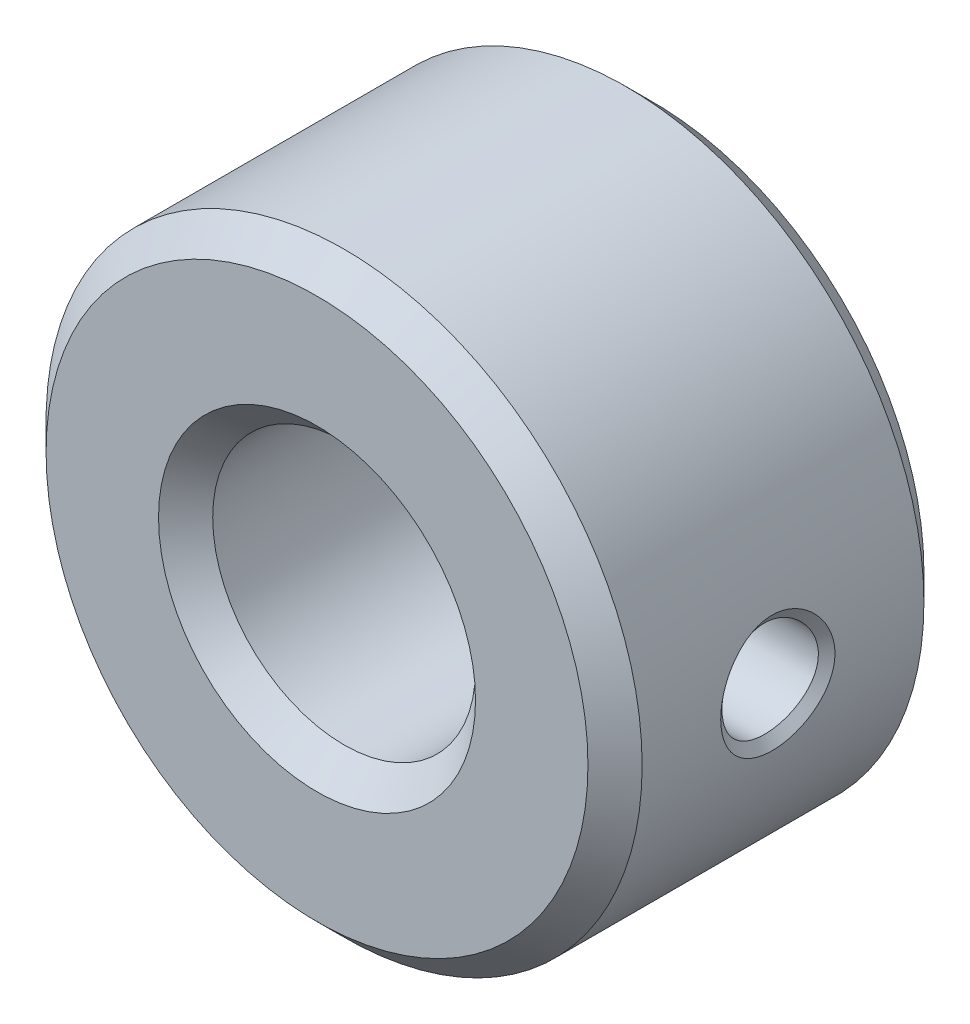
ISO-10303-21;
HEADER;
FILE_DESCRIPTION(('STEP AP214'),'2;1');
FILE_NAME('part.step','',(''),(''),'','','');
FILE_SCHEMA(('AUTOMOTIVE_DESIGN { 1 0 10303 214 1 1 1 1 }'));
ENDSEC;
DATA;
#1=APPLICATION_CONTEXT('core data for automotive mechanical design processes');
#2=APPLICATION_PROTOCOL_DEFINITION('international standard','automotive_design',2000,#1);
#3=PRODUCT_CONTEXT('',#1,'mechanical');
#4=PRODUCT('Part','Part','',(#3));
#5=PRODUCT_RELATED_PRODUCT_CATEGORY('part','',(#4));
#6=PRODUCT_DEFINITION_FORMATION('','',#4);
#7=PRODUCT_DEFINITION_CONTEXT('part definition',#1,'design');
#8=PRODUCT_DEFINITION('design','',#6,#7);
#9=PRODUCT_DEFINITION_SHAPE('','',#8);
#10=(LENGTH_UNIT() NAMED_UNIT(*) SI_UNIT(.MILLI.,.METRE.));
#11=(NAMED_UNIT(*) PLANE_ANGLE_UNIT() SI_UNIT($,.RADIAN.));
#12=(NAMED_UNIT(*) SI_UNIT($,.STERADIAN.) SOLID_ANGLE_UNIT());
#13=UNCERTAINTY_MEASURE_WITH_UNIT(LENGTH_MEASURE(1.E-05),#10,'distance_accuracy_value','');
#14=(GEOMETRIC_REPRESENTATION_CONTEXT(3) GLOBAL_UNCERTAINTY_ASSIGNED_CONTEXT((#13)) GLOBAL_UNIT_ASSIGNED_CONTEXT((#10,
#11,#12)) REPRESENTATION_CONTEXT('',''));
#15=CARTESIAN_POINT('',(0.,0.,0.));
#16=DIRECTION('',(0.,0.,1.));
#17=DIRECTION('',(1.,0.,0.));
#18=AXIS2_PLACEMENT_3D('',#15,#16,#17);
#19=CARTESIAN_POINT('',(0.,0.,-6.2));
#20=DIRECTION('',(0.,0.,1.));
#21=DIRECTION('',(1.,0.,0.));
#22=AXIS2_PLACEMENT_3D('',#19,#20,#21);
#23=CYLINDRICAL_SURFACE('',#22,5.5);
#24=CARTESIAN_POINT('',(5.49999962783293,-0.0020233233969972,-4.05906293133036));
#25=CARTESIAN_POINT('',(5.50048076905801,0.577972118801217,-4.06562856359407));
#26=CARTESIAN_POINT('',(5.39206294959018,1.08590926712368,-3.58242121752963));
#27=CARTESIAN_POINT('',(5.38868584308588,1.09937228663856,-2.45244036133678));
#28=CARTESIAN_POINT('',(5.4972295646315,0.604474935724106,-1.95690325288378));
#29=CARTESIAN_POINT('',(5.50267246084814,-0.558048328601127,-1.94368856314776));
#30=CARTESIAN_POINT('',(5.39612709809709,-1.06506206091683,-2.42805145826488));
#31=CARTESIAN_POINT('',(5.3929528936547,-1.07870866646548,-3.55795806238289));
#32=CARTESIAN_POINT('',(5.49951848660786,-0.582018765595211,-4.05249729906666));
#33=CARTESIAN_POINT('',(5.49999962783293,-0.00202332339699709,-4.05906293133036));
#34=B_SPLINE_CURVE_WITH_KNOTS('',3,(#24,#25,#26,#27,#28,#29,#30,#31,#32,#33),.UNSPECIFIED.,.T.,
.F.,(4,2,2,2,4),(-0.00660507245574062,-0.00495265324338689,-0.00330023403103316,
-0.00164781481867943,4.60439367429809E-06),.UNSPECIFIED.);
#35=CARTESIAN_POINT('',(5.49999962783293,-0.0020233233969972,-4.05906293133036));
#36=VERTEX_POINT('',#35);
#37=EDGE_CURVE('E10',#36,#36,#34,.F.);
#38=ORIENTED_EDGE('',*,*,#37,.T.);
#39=EDGE_LOOP('',(#38));
#40=FACE_BOUND('',#39,.T.);
#41=CARTESIAN_POINT('',(0.,0.,-5.69999999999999));
#42=DIRECTION('',(0.,0.,1.));
#43=DIRECTION('',(1.,0.,0.));
#44=AXIS2_PLACEMENT_3D('',#41,#42,#43);
#45=CIRCLE('',#44,5.5);
#46=CARTESIAN_POINT('',(5.5,0.,-5.69999999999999));
#47=VERTEX_POINT('',#46);
#48=EDGE_CURVE('E98',#47,#47,#45,.T.);
#49=ORIENTED_EDGE('',*,*,#48,.T.);
#50=EDGE_LOOP('',(#49));
#51=FACE_BOUND('',#50,.T.);
#52=CARTESIAN_POINT('',(0.,0.,-0.500000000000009));
#53=DIRECTION('',(0.,0.,1.));
#54=DIRECTION('',(1.,0.,0.));
#55=AXIS2_PLACEMENT_3D('',#52,#53,#54);
#56=CIRCLE('',#55,5.5);
#57=CARTESIAN_POINT('',(5.5,0.,-0.500000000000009));
#58=VERTEX_POINT('',#57);
#59=EDGE_CURVE('E92',#58,#58,#56,.F.);
#60=ORIENTED_EDGE('',*,*,#59,.T.);
#61=EDGE_LOOP('',(#60));
#62=FACE_BOUND('',#61,.T.);
#63=ADVANCED_FACE('F31',(#40,#51,#62),#23,.T.);
#64=CARTESIAN_POINT('',(0.,0.,-6.2));
#65=DIRECTION('',(0.,0.,1.));
#66=DIRECTION('',(1.,0.,0.));
#67=AXIS2_PLACEMENT_3D('',#64,#65,#66);
#68=PLANE('',#67);
#69=CARTESIAN_POINT('',(0.,0.,-6.2));
#70=DIRECTION('',(0.,0.,1.));
#71=DIRECTION('',(1.,0.,0.));
#72=AXIS2_PLACEMENT_3D('',#69,#70,#71);
#73=CIRCLE('',#72,4.99999999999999);
#74=CARTESIAN_POINT('',(4.99999999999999,0.,-6.2));
#75=VERTEX_POINT('',#74);
#76=EDGE_CURVE('E53',#75,#75,#73,.F.);
#77=ORIENTED_EDGE('',*,*,#76,.T.);
#78=EDGE_LOOP('',(#77));
#79=FACE_BOUND('',#78,.T.);
#80=CARTESIAN_POINT('',(0.,0.,-6.2));
#81=DIRECTION('',(0.,0.,1.));
#82=DIRECTION('',(1.,0.,0.));
#83=AXIS2_PLACEMENT_3D('',#80,#81,#82);
#84=CIRCLE('',#83,2.92499999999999);
#85=CARTESIAN_POINT('',(2.92499999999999,0.,-6.2));
#86=VERTEX_POINT('',#85);
#87=EDGE_CURVE('E58',#86,#86,#84,.T.);
#88=ORIENTED_EDGE('',*,*,#87,.T.);
#89=EDGE_LOOP('',(#88));
#90=FACE_BOUND('',#89,.T.);
#91=ADVANCED_FACE('F103',(#79,#90),#68,.F.);
#92=CARTESIAN_POINT('',(0.,0.,0.));
#93=DIRECTION('',(0.,0.,1.));
#94=DIRECTION('',(1.,0.,0.));
#95=AXIS2_PLACEMENT_3D('',#92,#93,#94);
#96=PLANE('',#95);
#97=CARTESIAN_POINT('',(0.,0.,0.));
#98=DIRECTION('',(0.,0.,1.));
#99=DIRECTION('',(1.,0.,0.));
#100=AXIS2_PLACEMENT_3D('',#97,#98,#99);
#101=CIRCLE('',#100,4.99999999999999);
#102=CARTESIAN_POINT('',(4.99999999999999,0.,0.));
#103=VERTEX_POINT('',#102);
#104=EDGE_CURVE('E89',#103,#103,#101,.T.);
#105=ORIENTED_EDGE('',*,*,#104,.T.);
#106=EDGE_LOOP('',(#105));
#107=FACE_BOUND('',#106,.T.);
#108=CARTESIAN_POINT('',(0.,0.,0.));
#109=DIRECTION('',(0.,0.,1.));
#110=DIRECTION('',(1.,0.,0.));
#111=AXIS2_PLACEMENT_3D('',#108,#109,#110);
#112=CIRCLE('',#111,2.925);
#113=CARTESIAN_POINT('',(2.925,0.,0.));
#114=VERTEX_POINT('',#113);
#115=EDGE_CURVE('E86',#114,#114,#112,.F.);
#116=ORIENTED_EDGE('',*,*,#115,.T.);
#117=EDGE_LOOP('',(#116));
#118=FACE_BOUND('',#117,.T.);
#119=ADVANCED_FACE('F119',(#107,#118),#96,.T.);
#120=CARTESIAN_POINT('',(0.,0.,-6.2));
#121=DIRECTION('',(0.,0.,1.));
#122=DIRECTION('',(1.,0.,0.));
#123=AXIS2_PLACEMENT_3D('',#120,#121,#122);
#124=CYLINDRICAL_SURFACE('',#123,2.425);
#125=CARTESIAN_POINT('',(2.425,0.,-3.89366711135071));
#126=CARTESIAN_POINT('',(2.42500102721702,0.0481868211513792,-3.89392162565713));
#127=CARTESIAN_POINT('',(2.42355108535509,0.0963846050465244,-3.89024310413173));
#128=CARTESIAN_POINT('',(2.41790409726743,0.191385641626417,-3.87517699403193));
#129=CARTESIAN_POINT('',(2.41370734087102,0.238189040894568,-3.86379021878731));
#130=CARTESIAN_POINT('',(2.40301120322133,0.329016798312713,-3.83376248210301));
#131=CARTESIAN_POINT('',(2.39651608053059,0.373046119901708,-3.81513493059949));
#132=CARTESIAN_POINT('',(2.38186717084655,0.457347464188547,-3.77122421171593));
#133=CARTESIAN_POINT('',(2.37371295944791,0.497618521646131,-3.74593934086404));
#134=CARTESIAN_POINT('',(2.35621512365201,0.57489368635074,-3.68836267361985));
#135=CARTESIAN_POINT('',(2.34683894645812,0.611724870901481,-3.65584878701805));
#136=CARTESIAN_POINT('',(2.32810501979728,0.679553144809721,-3.58519960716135));
#137=CARTESIAN_POINT('',(2.31874727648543,0.710548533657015,-3.54706268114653));
#138=CARTESIAN_POINT('',(2.30071890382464,0.766960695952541,-3.46452816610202));
#139=CARTESIAN_POINT('',(2.29208661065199,0.792128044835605,-3.41995088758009));
#140=CARTESIAN_POINT('',(2.27698935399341,0.834538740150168,-3.32683315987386));
#141=CARTESIAN_POINT('',(2.27052359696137,0.851784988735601,-3.27829416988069));
#142=CARTESIAN_POINT('',(2.26083018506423,0.877183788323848,-3.18057917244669));
#143=CARTESIAN_POINT('',(2.25748785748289,0.885659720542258,-3.13149898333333));
#144=CARTESIAN_POINT('',(2.25408260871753,0.8942930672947,-3.03250778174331));
#145=CARTESIAN_POINT('',(2.25401837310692,0.894453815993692,-2.98259711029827));
#146=CARTESIAN_POINT('',(2.25708165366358,0.886691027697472,-2.88641775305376));
#147=CARTESIAN_POINT('',(2.2600258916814,0.879231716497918,-2.84010464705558));
#148=CARTESIAN_POINT('',(2.26846584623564,0.857219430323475,-2.74944282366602));
#149=CARTESIAN_POINT('',(2.2739619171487,0.842665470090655,-2.70509438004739));
#150=CARTESIAN_POINT('',(2.28698814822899,0.806647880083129,-2.61873212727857));
#151=CARTESIAN_POINT('',(2.29455114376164,0.785071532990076,-2.57677049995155));
#152=CARTESIAN_POINT('',(2.31085463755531,0.735697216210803,-2.49693333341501));
#153=CARTESIAN_POINT('',(2.3195955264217,0.707897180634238,-2.45905915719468));
#154=CARTESIAN_POINT('',(2.33795826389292,0.64476559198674,-2.38591716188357));
#155=CARTESIAN_POINT('',(2.34760067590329,0.60906563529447,-2.35097176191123));
#156=CARTESIAN_POINT('',(2.36620789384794,0.532209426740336,-2.28746873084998));
#157=CARTESIAN_POINT('',(2.37517259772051,0.491052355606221,-2.25891206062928));
#158=CARTESIAN_POINT('',(2.391599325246,0.403590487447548,-2.20861606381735));
#159=CARTESIAN_POINT('',(2.39903576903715,0.35721549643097,-2.1869898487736));
#160=CARTESIAN_POINT('',(2.41138309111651,0.261145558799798,-2.15195419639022));
#161=CARTESIAN_POINT('',(2.41629502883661,0.211452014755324,-2.13854131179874));
#162=CARTESIAN_POINT('',(2.42285082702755,0.112853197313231,-2.12093901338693));
#163=CARTESIAN_POINT('',(2.42464742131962,0.0640351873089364,-2.11631738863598));
#164=CARTESIAN_POINT('',(2.42525776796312,-0.0337093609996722,-2.11516522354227));
#165=CARTESIAN_POINT('',(2.42407216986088,-0.0826358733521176,-2.1186329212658));
#166=CARTESIAN_POINT('',(2.41895782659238,-0.177293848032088,-2.13323080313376));
#167=CARTESIAN_POINT('',(2.41513312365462,-0.223076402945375,-2.14407014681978));
#168=CARTESIAN_POINT('',(2.40524413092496,-0.312146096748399,-2.17271676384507));
#169=CARTESIAN_POINT('',(2.39917955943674,-0.355432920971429,-2.19052491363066));
#170=CARTESIAN_POINT('',(2.38520874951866,-0.439633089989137,-2.23314058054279));
#171=CARTESIAN_POINT('',(2.37725595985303,-0.480446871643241,-2.25812907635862));
#172=CARTESIAN_POINT('',(2.3603911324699,-0.557435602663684,-2.31419548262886));
#173=CARTESIAN_POINT('',(2.35147875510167,-0.593608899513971,-2.34527555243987));
#174=CARTESIAN_POINT('',(2.33306631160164,-0.662393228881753,-2.41467790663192));
#175=CARTESIAN_POINT('',(2.32356112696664,-0.694694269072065,-2.45330683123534));
#176=CARTESIAN_POINT('',(2.30551808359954,-0.752415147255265,-2.53561701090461));
#177=CARTESIAN_POINT('',(2.29698030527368,-0.777834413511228,-2.57929868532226));
#178=CARTESIAN_POINT('',(2.28187594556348,-0.821095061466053,-2.67082119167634));
#179=CARTESIAN_POINT('',(2.27531741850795,-0.838905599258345,-2.71867802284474));
#180=CARTESIAN_POINT('',(2.26510696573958,-0.866100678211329,-2.81701730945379));
#181=CARTESIAN_POINT('',(2.26145335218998,-0.875490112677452,-2.86749822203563));
#182=CARTESIAN_POINT('',(2.25769762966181,-0.885127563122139,-2.96632780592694));
#183=CARTESIAN_POINT('',(2.257391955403,-0.885899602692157,-3.01461803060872));
#184=CARTESIAN_POINT('',(2.25984391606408,-0.879625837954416,-3.11060403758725));
#185=CARTESIAN_POINT('',(2.26260125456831,-0.872580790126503,-3.15829987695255));
#186=CARTESIAN_POINT('',(2.27069684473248,-0.851283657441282,-3.25032656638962));
#187=CARTESIAN_POINT('',(2.27595725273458,-0.83724838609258,-3.2947150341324));
#188=CARTESIAN_POINT('',(2.28841764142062,-0.802563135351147,-3.38053318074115));
#189=CARTESIAN_POINT('',(2.29561809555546,-0.781911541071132,-3.42196213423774));
#190=CARTESIAN_POINT('',(2.31159024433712,-0.733387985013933,-3.50292876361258));
#191=CARTESIAN_POINT('',(2.32042230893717,-0.705207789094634,-3.5422696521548));
#192=CARTESIAN_POINT('',(2.33845076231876,-0.642902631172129,-3.61583606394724));
#193=CARTESIAN_POINT('',(2.34764726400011,-0.608775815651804,-3.65005998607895));
#194=CARTESIAN_POINT('',(2.36593362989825,-0.533440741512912,-3.71422258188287));
#195=CARTESIAN_POINT('',(2.37499345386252,-0.491957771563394,-3.7438486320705));
#196=CARTESIAN_POINT('',(2.39147642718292,-0.404292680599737,-3.79570133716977));
#197=CARTESIAN_POINT('',(2.39889954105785,-0.35811045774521,-3.8179278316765));
#198=CARTESIAN_POINT('',(2.4114244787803,-0.260989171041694,-3.85469505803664));
#199=CARTESIAN_POINT('',(2.41645719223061,-0.209954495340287,-3.86900872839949));
#200=CARTESIAN_POINT('',(2.42324363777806,-0.105950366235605,-3.88835271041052));
#201=CARTESIAN_POINT('',(2.42499887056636,-0.0529818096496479,-3.89338727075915));
#202=CARTESIAN_POINT('',(2.425,0.,-3.89366711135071));
#203=B_SPLINE_CURVE_WITH_KNOTS('',3,(#125,#126,#127,#128,#129,#130,#131,#132,#133,#134,#135,
#136,#137,#138,#139,#140,#141,#142,#143,#144,#145,#146,#147,#148,#149,#150,#151,#152,#153,#154,
#155,#156,#157,#158,#159,#160,#161,#162,#163,#164,#165,#166,#167,#168,#169,#170,#171,#172,#173,
#174,#175,#176,#177,#178,#179,#180,#181,#182,#183,#184,#185,#186,#187,#188,#189,#190,#191,#192,
#193,#194,#195,#196,#197,#198,#199,#200,#201,#202),.UNSPECIFIED.,.T.,.F.,(4,2,2,2,2,2,2,2,2,2,2,
2,2,2,2,2,2,2,2,2,2,2,2,2,2,2,2,2,2,2,2,2,2,2,2,2,2,2,4),(0.,0.144367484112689,
0.288719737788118,0.432805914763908,0.57692899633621,0.726313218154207,0.875740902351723,
1.03070847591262,1.18561922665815,1.33458910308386,1.48349924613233,1.62384870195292,
1.76421765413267,1.90696104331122,2.04975188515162,2.20169052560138,2.35365200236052,
2.50798036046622,2.66224390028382,2.80870474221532,2.95513368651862,3.09609703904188,
3.23707812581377,3.3819822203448,3.52693777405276,3.67995487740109,3.83298468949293,
3.98662909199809,4.14018415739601,4.28434671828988,4.42849532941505,4.56842796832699,
4.70839478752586,4.85532861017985,5.00230831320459,5.15687933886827,5.31145371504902,
5.47025969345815,5.62899294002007),.UNSPECIFIED.);
#204=CARTESIAN_POINT('',(2.425,0.,-3.89366711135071));
#205=VERTEX_POINT('',#204);
#206=EDGE_CURVE('E81',#205,#205,#203,.T.);
#207=ORIENTED_EDGE('',*,*,#206,.T.);
#208=EDGE_LOOP('',(#207));
#209=FACE_BOUND('',#208,.T.);
#210=CARTESIAN_POINT('',(0.,0.,-5.70000000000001));
#211=DIRECTION('',(0.,0.,1.));
#212=DIRECTION('',(1.,0.,0.));
#213=AXIS2_PLACEMENT_3D('',#210,#211,#212);
#214=CIRCLE('',#213,2.425);
#215=CARTESIAN_POINT('',(2.425,0.,-5.70000000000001));
#216=VERTEX_POINT('',#215);
#217=EDGE_CURVE('E48',#216,#216,#214,.F.);
#218=ORIENTED_EDGE('',*,*,#217,.T.);
#219=EDGE_LOOP('',(#218));
#220=FACE_BOUND('',#219,.T.);
#221=CARTESIAN_POINT('',(0.,0.,-0.5));
#222=DIRECTION('',(0.,0.,1.));
#223=DIRECTION('',(1.,0.,0.));
#224=AXIS2_PLACEMENT_3D('',#221,#222,#223);
#225=CIRCLE('',#224,2.425);
#226=CARTESIAN_POINT('',(2.425,0.,-0.5));
#227=VERTEX_POINT('',#226);
#228=EDGE_CURVE('E95',#227,#227,#225,.T.);
#229=ORIENTED_EDGE('',*,*,#228,.T.);
#230=EDGE_LOOP('',(#229));
#231=FACE_BOUND('',#230,.T.);
#232=ADVANCED_FACE('F76',(#209,#220,#231),#124,.F.);
#233=CARTESIAN_POINT('',(0.,0.,0.));
#234=DIRECTION('',(0.,0.,-1.));
#235=DIRECTION('',(-1.,0.,0.));
#236=AXIS2_PLACEMENT_3D('',#233,#234,#235);
#237=CONICAL_SURFACE('',#236,4.99999999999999,0.785398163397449);
#238=ORIENTED_EDGE('',*,*,#59,.F.);
#239=EDGE_LOOP('',(#238));
#240=FACE_BOUND('',#239,.T.);
#241=ORIENTED_EDGE('',*,*,#104,.F.);
#242=EDGE_LOOP('',(#241));
#243=FACE_BOUND('',#242,.T.);
#244=ADVANCED_FACE('F125',(#240,#243),#237,.T.);
#245=CARTESIAN_POINT('',(0.,0.,-0.5));
#246=DIRECTION('',(0.,0.,1.));
#247=DIRECTION('',(1.,0.,0.));
#248=AXIS2_PLACEMENT_3D('',#245,#246,#247);
#249=CONICAL_SURFACE('',#248,2.425,0.785398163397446);
#250=ORIENTED_EDGE('',*,*,#115,.F.);
#251=EDGE_LOOP('',(#250));
#252=FACE_BOUND('',#251,.T.);
#253=ORIENTED_EDGE('',*,*,#228,.F.);
#254=EDGE_LOOP('',(#253));
#255=FACE_BOUND('',#254,.T.);
#256=ADVANCED_FACE('F111',(#252,#255),#249,.F.);
#257=CARTESIAN_POINT('',(0.,0.,-5.69999999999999));
#258=DIRECTION('',(0.,0.,1.));
#259=DIRECTION('',(1.,0.,0.));
#260=AXIS2_PLACEMENT_3D('',#257,#258,#259);
#261=CONICAL_SURFACE('',#260,5.5,0.785398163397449);
#262=ORIENTED_EDGE('',*,*,#76,.F.);
#263=EDGE_LOOP('',(#262));
#264=FACE_BOUND('',#263,.T.);
#265=ORIENTED_EDGE('',*,*,#48,.F.);
#266=EDGE_LOOP('',(#265));
#267=FACE_BOUND('',#266,.T.);
#268=ADVANCED_FACE('F106',(#264,#267),#261,.T.);
#269=CARTESIAN_POINT('',(0.,0.,-6.2));
#270=DIRECTION('',(0.,0.,-1.));
#271=DIRECTION('',(-1.,0.,0.));
#272=AXIS2_PLACEMENT_3D('',#269,#270,#271);
#273=CONICAL_SURFACE('',#272,2.92499999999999,0.785398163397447);
#274=ORIENTED_EDGE('',*,*,#217,.F.);
#275=EDGE_LOOP('',(#274));
#276=FACE_BOUND('',#275,.T.);
#277=ORIENTED_EDGE('',*,*,#87,.F.);
#278=EDGE_LOOP('',(#277));
#279=FACE_BOUND('',#278,.T.);
#280=ADVANCED_FACE('F75',(#276,#279),#273,.F.);
#281=CARTESIAN_POINT('',(5.49998980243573,0.0105911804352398,-3.00467937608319));
#282=DIRECTION('',(0.999998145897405,0.0019256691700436,0.));
#283=DIRECTION('',(-0.0019256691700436,0.999998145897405,0.));
#284=AXIS2_PLACEMENT_3D('',#281,#282,#283);
#285=CYLINDRICAL_SURFACE('',#284,0.888999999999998);
#286=CARTESIAN_POINT('',(5.35830769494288,-4.28456861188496E-05,-3.89361899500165));
#287=CARTESIAN_POINT('',(5.35828806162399,-0.0148727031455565,-3.89344757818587));
#288=CARTESIAN_POINT('',(5.35816767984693,-0.0296973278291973,-3.8928750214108));
#289=CARTESIAN_POINT('',(5.35773658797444,-0.0591913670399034,-3.89094251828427));
#290=CARTESIAN_POINT('',(5.35742717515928,-0.0738611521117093,-3.8895879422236));
#291=CARTESIAN_POINT('',(5.35663081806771,-0.103023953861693,-3.88611315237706));
#292=CARTESIAN_POINT('',(5.35614484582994,-0.117517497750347,-3.8839971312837));
#293=CARTESIAN_POINT('',(5.35500851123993,-0.146306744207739,-3.87902236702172));
#294=CARTESIAN_POINT('',(5.35435885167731,-0.160603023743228,-3.87616679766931));
#295=CARTESIAN_POINT('',(5.35290811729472,-0.188976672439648,-3.86973532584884));
#296=CARTESIAN_POINT('',(5.35210753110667,-0.203054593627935,-3.866161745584));
#297=CARTESIAN_POINT('',(5.35036789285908,-0.230970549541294,-3.85831656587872));
#298=CARTESIAN_POINT('',(5.34942916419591,-0.244809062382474,-3.85404659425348));
#299=CARTESIAN_POINT('',(5.34742613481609,-0.272225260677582,-3.84483076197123));
#300=CARTESIAN_POINT('',(5.34636203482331,-0.285803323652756,-3.83988597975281));
#301=CARTESIAN_POINT('',(5.3441211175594,-0.312677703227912,-3.82934251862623));
#302=CARTESIAN_POINT('',(5.34294441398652,-0.325974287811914,-3.82374449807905));
#303=CARTESIAN_POINT('',(5.34049110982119,-0.352264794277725,-3.81191642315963));
#304=CARTESIAN_POINT('',(5.3392145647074,-0.365258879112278,-3.80568671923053));
#305=CARTESIAN_POINT('',(5.33657437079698,-0.390923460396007,-3.79261703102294));
#306=CARTESIAN_POINT('',(5.33521074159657,-0.403594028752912,-3.7857771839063));
#307=CARTESIAN_POINT('',(5.33240915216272,-0.42859063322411,-3.77150887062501));
#308=CARTESIAN_POINT('',(5.33097119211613,-0.440916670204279,-3.76408040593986));
#309=CARTESIAN_POINT('',(5.32803369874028,-0.465203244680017,-3.74865644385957));
#310=CARTESIAN_POINT('',(5.32653415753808,-0.477163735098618,-3.74066087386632));
#311=CARTESIAN_POINT('',(5.32348624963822,-0.500698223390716,-3.72412422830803));
#312=CARTESIAN_POINT('',(5.32193787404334,-0.512272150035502,-3.71558305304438));
#313=CARTESIAN_POINT('',(5.31880503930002,-0.535012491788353,-3.6979766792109));
#314=CARTESIAN_POINT('',(5.31722057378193,-0.546178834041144,-3.68891138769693));
#315=CARTESIAN_POINT('',(5.31402829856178,-0.568082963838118,-3.67027823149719));
#316=CARTESIAN_POINT('',(5.31242048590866,-0.578820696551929,-3.66071030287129));
#317=CARTESIAN_POINT('',(5.30919425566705,-0.599846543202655,-3.64109330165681));
#318=CARTESIAN_POINT('',(5.30757583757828,-0.610134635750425,-3.63104420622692));
#319=CARTESIAN_POINT('',(5.30434113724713,-0.630240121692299,-3.61048628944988));
#320=CARTESIAN_POINT('',(5.3027248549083,-0.640057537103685,-3.59997748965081));
#321=CARTESIAN_POINT('',(5.29950716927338,-0.659200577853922,-3.57852157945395));
#322=CARTESIAN_POINT('',(5.29790576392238,-0.668526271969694,-3.56757453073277));
#323=CARTESIAN_POINT('',(5.29473057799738,-0.686664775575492,-3.54526354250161));
#324=CARTESIAN_POINT('',(5.29315679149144,-0.695477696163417,-3.53389969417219));
#325=CARTESIAN_POINT('',(5.29004959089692,-0.712569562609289,-3.51077653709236));
#326=CARTESIAN_POINT('',(5.28851616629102,-0.720848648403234,-3.49901733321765));
#327=CARTESIAN_POINT('',(5.28550243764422,-0.736851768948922,-3.47512491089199));
#328=CARTESIAN_POINT('',(5.28402211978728,-0.744575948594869,-3.46299179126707));
#329=CARTESIAN_POINT('',(5.28112735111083,-0.759448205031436,-3.43837300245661));
#330=CARTESIAN_POINT('',(5.27971288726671,-0.766596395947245,-3.42588740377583));
#331=CARTESIAN_POINT('',(5.27696256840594,-0.780295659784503,-3.40058514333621));
#332=CARTESIAN_POINT('',(5.27562670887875,-0.786846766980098,-3.38776850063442));
#333=CARTESIAN_POINT('',(5.2730463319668,-0.799330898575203,-3.36182566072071));
#334=CARTESIAN_POINT('',(5.27180183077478,-0.805263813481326,-3.34869940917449));
#335=CARTESIAN_POINT('',(5.26941689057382,-0.816490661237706,-3.32215888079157));
#336=CARTESIAN_POINT('',(5.26827650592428,-0.821784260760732,-3.308744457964));
#337=CARTESIAN_POINT('',(5.26611250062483,-0.831711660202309,-3.28164913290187));
#338=CARTESIAN_POINT('',(5.26508899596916,-0.836344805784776,-3.26796798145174));
#339=CARTESIAN_POINT('',(5.26317142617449,-0.844930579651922,-3.24036075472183));
#340=CARTESIAN_POINT('',(5.26227756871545,-0.848882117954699,-3.22643432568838));
#341=CARTESIAN_POINT('',(5.2606319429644,-0.85608407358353,-3.19835809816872));
#342=CARTESIAN_POINT('',(5.2598805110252,-0.859332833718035,-3.18420785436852));
#343=CARTESIAN_POINT('',(5.25853232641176,-0.865108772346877,-3.15570553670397));
#344=CARTESIAN_POINT('',(5.25793608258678,-0.867633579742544,-3.14135295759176));
#345=CARTESIAN_POINT('',(5.25691089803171,-0.871941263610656,-3.11246747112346));
#346=CARTESIAN_POINT('',(5.25648268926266,-0.873720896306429,-3.09793405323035));
#347=CARTESIAN_POINT('',(5.25580585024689,-0.876518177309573,-3.06870834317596));
#348=CARTESIAN_POINT('',(5.2555582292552,-0.877531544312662,-3.05401561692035));
#349=CARTESIAN_POINT('',(5.25525590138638,-0.87877588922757,-3.02449261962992));
#350=CARTESIAN_POINT('',(5.25520254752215,-0.879001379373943,-3.00966210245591));
#351=CARTESIAN_POINT('',(5.25529742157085,-0.878653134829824,-2.98000948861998));
#352=CARTESIAN_POINT('',(5.25544567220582,-0.878079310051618,-2.96518739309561));
#353=CARTESIAN_POINT('',(5.25593021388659,-0.876144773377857,-2.93569775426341));
#354=CARTESIAN_POINT('',(5.25626523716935,-0.874789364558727,-2.92102984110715));
#355=CARTESIAN_POINT('',(5.25711110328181,-0.8713139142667,-2.89186987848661));
#356=CARTESIAN_POINT('',(5.2576209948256,-0.86919800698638,-2.87737730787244));
#357=CARTESIAN_POINT('',(5.25880331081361,-0.864224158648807,-2.8485892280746));
#358=CARTESIAN_POINT('',(5.25947504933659,-0.861369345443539,-2.83429314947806));
#359=CARTESIAN_POINT('',(5.26096812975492,-0.854939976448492,-2.80591915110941));
#360=CARTESIAN_POINT('',(5.2617889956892,-0.851367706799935,-2.79184068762));
#361=CARTESIAN_POINT('',(5.26356737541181,-0.843525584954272,-2.76392295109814));
#362=CARTESIAN_POINT('',(5.26452457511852,-0.839257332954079,-2.75008320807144));
#363=CARTESIAN_POINT('',(5.26656273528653,-0.830045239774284,-2.72266390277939));
#364=CARTESIAN_POINT('',(5.26764350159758,-0.825102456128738,-2.70908397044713));
#365=CARTESIAN_POINT('',(5.26991594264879,-0.814563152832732,-2.68220525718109));
#366=CARTESIAN_POINT('',(5.27110750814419,-0.808967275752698,-2.6689062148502));
#367=CARTESIAN_POINT('',(5.27358873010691,-0.797143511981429,-2.64261024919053));
#368=CARTESIAN_POINT('',(5.274878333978,-0.790915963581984,-2.62961316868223));
#369=CARTESIAN_POINT('',(5.27754284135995,-0.777850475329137,-2.60394210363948));
#370=CARTESIAN_POINT('',(5.27891772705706,-0.771012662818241,-2.59126805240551));
#371=CARTESIAN_POINT('',(5.28174002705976,-0.75674817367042,-2.56626404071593));
#372=CARTESIAN_POINT('',(5.28318744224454,-0.749321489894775,-2.55393408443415));
#373=CARTESIAN_POINT('',(5.28614204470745,-0.733900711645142,-2.52963928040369));
#374=CARTESIAN_POINT('',(5.28764924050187,-0.725906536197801,-2.51767448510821));
#375=CARTESIAN_POINT('',(5.29071065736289,-0.709372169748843,-2.49413104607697));
#376=CARTESIAN_POINT('',(5.29226488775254,-0.70083187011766,-2.48255247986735));
#377=CARTESIAN_POINT('',(5.29540763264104,-0.683226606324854,-2.45980256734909));
#378=CARTESIAN_POINT('',(5.29699615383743,-0.674161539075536,-2.44863130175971));
#379=CARTESIAN_POINT('',(5.30019474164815,-0.655528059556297,-2.42671708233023));
#380=CARTESIAN_POINT('',(5.30180481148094,-0.645959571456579,-2.41597419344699));
#381=CARTESIAN_POINT('',(5.30503375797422,-0.62634054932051,-2.39493783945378));
#382=CARTESIAN_POINT('',(5.30665263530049,-0.61628997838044,-2.38464440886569));
#383=CARTESIAN_POINT('',(5.30988645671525,-0.595728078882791,-2.36452809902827));
#384=CARTESIAN_POINT('',(5.31150140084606,-0.585216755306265,-2.3547052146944));
#385=CARTESIAN_POINT('',(5.31471461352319,-0.563754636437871,-2.33555113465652));
#386=CARTESIAN_POINT('',(5.31631288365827,-0.552803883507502,-2.32621989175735));
#387=CARTESIAN_POINT('',(5.31948000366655,-0.53048419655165,-2.30807023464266));
#388=CARTESIAN_POINT('',(5.32104885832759,-0.519115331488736,-2.29925173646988));
#389=CARTESIAN_POINT('',(5.32414440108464,-0.495980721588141,-2.28214870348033));
#390=CARTESIAN_POINT('',(5.32567109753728,-0.484215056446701,-2.27386406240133));
#391=CARTESIAN_POINT('',(5.32866957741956,-0.460308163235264,-2.25784986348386));
#392=CARTESIAN_POINT('',(5.33014137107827,-0.448167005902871,-2.25012020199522));
#393=CARTESIAN_POINT('',(5.33301730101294,-0.423530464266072,-2.23523705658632));
#394=CARTESIAN_POINT('',(5.33442144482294,-0.411035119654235,-2.22808350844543));
#395=CARTESIAN_POINT('',(5.33714933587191,-0.385711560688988,-2.21437364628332));
#396=CARTESIAN_POINT('',(5.33847307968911,-0.372883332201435,-2.20781735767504));
#397=CARTESIAN_POINT('',(5.34102744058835,-0.34691538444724,-2.19532301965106));
#398=CARTESIAN_POINT('',(5.34225803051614,-0.333775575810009,-2.18938515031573));
#399=CARTESIAN_POINT('',(5.34461336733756,-0.307205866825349,-2.17814858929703));
#400=CARTESIAN_POINT('',(5.3457380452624,-0.293775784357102,-2.17285031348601));
#401=CARTESIAN_POINT('',(5.3478688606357,-0.266646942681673,-2.16291379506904));
#402=CARTESIAN_POINT('',(5.34887486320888,-0.25294789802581,-2.15827630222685));
#403=CARTESIAN_POINT('',(5.35075565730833,-0.225302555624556,-2.14968210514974));
#404=CARTESIAN_POINT('',(5.35163021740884,-0.211355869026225,-2.14572659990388));
#405=CARTESIAN_POINT('',(5.3532354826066,-0.183236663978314,-2.13851701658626));
#406=CARTESIAN_POINT('',(5.35396582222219,-0.169063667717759,-2.13526471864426));
#407=CARTESIAN_POINT('',(5.35527006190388,-0.140513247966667,-2.12948205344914));
#408=CARTESIAN_POINT('',(5.35584341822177,-0.126135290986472,-2.12695419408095));
#409=CARTESIAN_POINT('',(5.35682107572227,-0.0971963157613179,-2.12264076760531));
#410=CARTESIAN_POINT('',(5.35722460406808,-0.0826347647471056,-2.12085859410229));
#411=CARTESIAN_POINT('',(5.35785032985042,-0.0533499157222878,-2.11805672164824));
#412=CARTESIAN_POINT('',(5.3580714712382,-0.0386261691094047,-2.11704146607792));
#413=CARTESIAN_POINT('',(5.35831911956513,-0.00903812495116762,-2.11579352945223));
#414=CARTESIAN_POINT('',(5.35834422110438,0.00582642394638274,-2.11556650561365));
#415=CARTESIAN_POINT('',(5.35819129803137,0.0355457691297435,-2.11591316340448));
#416=CARTESIAN_POINT('',(5.35801326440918,0.05040056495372,-2.11648688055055));
#417=CARTESIAN_POINT('',(5.35746774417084,0.079949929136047,-2.11842418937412));
#418=CARTESIAN_POINT('',(5.35710159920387,0.0946448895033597,-2.1197821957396));
#419=CARTESIAN_POINT('',(5.35619220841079,0.123853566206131,-2.12326521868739));
#420=CARTESIAN_POINT('',(5.35564997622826,0.138367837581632,-2.12538585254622));
#421=CARTESIAN_POINT('',(5.35440179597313,0.16719423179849,-2.13037136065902));
#422=CARTESIAN_POINT('',(5.35369658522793,0.18150696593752,-2.1332328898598));
#423=CARTESIAN_POINT('',(5.35213548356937,0.209909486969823,-2.13967761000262));
#424=CARTESIAN_POINT('',(5.35128011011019,0.223999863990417,-2.14325832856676));
#425=CARTESIAN_POINT('',(5.3494317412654,0.251936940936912,-2.15111901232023));
#426=CARTESIAN_POINT('',(5.34843909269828,0.265784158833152,-2.15539722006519));
#427=CARTESIAN_POINT('',(5.34632916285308,0.293214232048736,-2.16463062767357));
#428=CARTESIAN_POINT('',(5.3452121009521,0.306797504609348,-2.16958463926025));
#429=CARTESIAN_POINT('',(5.34286629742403,0.333679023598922,-2.18014754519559));
#430=CARTESIAN_POINT('',(5.34163768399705,0.346977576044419,-2.18575568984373));
#431=CARTESIAN_POINT('',(5.33908169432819,0.373268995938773,-2.19760488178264));
#432=CARTESIAN_POINT('',(5.33775438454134,0.386262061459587,-2.20384550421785));
#433=CARTESIAN_POINT('',(5.33501389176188,0.411921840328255,-2.21693778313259));
#434=CARTESIAN_POINT('',(5.33360073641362,0.424588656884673,-2.22378924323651));
#435=CARTESIAN_POINT('',(5.33070142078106,0.449575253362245,-2.23808142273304));
#436=CARTESIAN_POINT('',(5.32921526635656,0.461895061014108,-2.24552209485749));
#437=CARTESIAN_POINT('',(5.32618280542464,0.486166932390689,-2.26097100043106));
#438=CARTESIAN_POINT('',(5.32463649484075,0.498118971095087,-2.26897927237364));
#439=CARTESIAN_POINT('',(5.32149656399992,0.521634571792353,-2.28554174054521));
#440=CARTESIAN_POINT('',(5.31990293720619,0.53319807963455,-2.294096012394));
#441=CARTESIAN_POINT('',(5.31668121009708,0.555915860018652,-2.31172888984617));
#442=CARTESIAN_POINT('',(5.31505310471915,0.56707007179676,-2.32080757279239));
#443=CARTESIAN_POINT('',(5.31177525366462,0.588948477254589,-2.3394677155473));
#444=CARTESIAN_POINT('',(5.31012550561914,0.599672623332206,-2.34904923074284));
#445=CARTESIAN_POINT('',(5.30681720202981,0.620670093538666,-2.368693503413));
#446=CARTESIAN_POINT('',(5.30515864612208,0.63094339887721,-2.37875628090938));
#447=CARTESIAN_POINT('',(5.30184556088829,0.651018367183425,-2.39934155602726));
#448=CARTESIAN_POINT('',(5.30019103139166,0.660820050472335,-2.40986403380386));
#449=CARTESIAN_POINT('',(5.29689883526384,0.679930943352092,-2.43134719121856));
#450=CARTESIAN_POINT('',(5.29526116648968,0.689240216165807,-2.44230781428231));
#451=CARTESIAN_POINT('',(5.29201553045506,0.707345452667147,-2.46464574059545));
#452=CARTESIAN_POINT('',(5.29040755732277,0.716141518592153,-2.4760229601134));
#453=CARTESIAN_POINT('',(5.28723415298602,0.73319950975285,-2.49917254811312));
#454=CARTESIAN_POINT('',(5.28566871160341,0.741461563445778,-2.51094482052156));
#455=CARTESIAN_POINT('',(5.28259321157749,0.757430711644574,-2.53486296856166));
#456=CARTESIAN_POINT('',(5.2810831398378,0.765137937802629,-2.54700875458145));
#457=CARTESIAN_POINT('',(5.27813121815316,0.779976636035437,-2.57165236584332));
#458=CARTESIAN_POINT('',(5.27668935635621,0.7871082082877,-2.58415012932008));
#459=CARTESIAN_POINT('',(5.27388668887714,0.800774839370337,-2.60947611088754));
#460=CARTESIAN_POINT('',(5.27252588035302,0.807309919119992,-2.62230431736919));
#461=CARTESIAN_POINT('',(5.26989814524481,0.819762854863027,-2.64826957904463));
#462=CARTESIAN_POINT('',(5.26863123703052,0.825680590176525,-2.66140669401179));
#463=CARTESIAN_POINT('',(5.26620411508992,0.836878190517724,-2.68796814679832));
#464=CARTESIAN_POINT('',(5.26504395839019,0.842157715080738,-2.70139263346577));
#465=CARTESIAN_POINT('',(5.26284313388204,0.852058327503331,-2.7285071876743));
#466=CARTESIAN_POINT('',(5.26180258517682,0.856678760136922,-2.74219750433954));
#467=CARTESIAN_POINT('',(5.25985374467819,0.865240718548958,-2.76982206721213));
#468=CARTESIAN_POINT('',(5.25894566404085,0.869181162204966,-2.78375666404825));
#469=CARTESIAN_POINT('',(5.25727450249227,0.876362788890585,-2.81184813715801));
#470=CARTESIAN_POINT('',(5.25651176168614,0.879602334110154,-2.82600545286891));
#471=CARTESIAN_POINT('',(5.25514396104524,0.885361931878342,-2.85452072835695));
#472=CARTESIAN_POINT('',(5.25453941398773,0.887879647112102,-2.86887918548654));
#473=CARTESIAN_POINT('',(5.253500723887,0.892175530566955,-2.89777514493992));
#474=CARTESIAN_POINT('',(5.25306731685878,0.893950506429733,-2.91231314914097));
#475=CARTESIAN_POINT('',(5.25238325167,0.896740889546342,-2.9415466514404));
#476=CARTESIAN_POINT('',(5.25213360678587,0.897752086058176,-2.95624257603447));
#477=CARTESIAN_POINT('',(5.2518305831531,0.898995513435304,-2.98577048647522));
#478=CARTESIAN_POINT('',(5.25177856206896,0.899222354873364,-3.00060271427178));
#479=CARTESIAN_POINT('',(5.25187918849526,0.898877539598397,-3.03025710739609));
#480=CARTESIAN_POINT('',(5.25203183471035,0.898305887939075,-3.04507927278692));
#481=CARTESIAN_POINT('',(5.25252786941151,0.896373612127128,-3.07456718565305));
#482=CARTESIAN_POINT('',(5.25286994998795,0.895018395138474,-3.08923331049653));
#483=CARTESIAN_POINT('',(5.25373264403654,0.891542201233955,-3.11838796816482));
#484=CARTESIAN_POINT('',(5.25425227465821,0.889425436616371,-3.13287703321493));
#485=CARTESIAN_POINT('',(5.25545668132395,0.884448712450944,-3.16165648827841));
#486=CARTESIAN_POINT('',(5.2561407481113,0.881591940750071,-3.17594746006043));
#487=CARTESIAN_POINT('',(5.2576610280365,0.875157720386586,-3.20430975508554));
#488=CARTESIAN_POINT('',(5.25849674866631,0.87158260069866,-3.21838163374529));
#489=CARTESIAN_POINT('',(5.26030730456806,0.863733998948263,-3.24628483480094));
#490=CARTESIAN_POINT('',(5.26128181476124,0.859462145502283,-3.26011663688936));
#491=CARTESIAN_POINT('',(5.26335698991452,0.850242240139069,-3.287518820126));
#492=CARTESIAN_POINT('',(5.26445745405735,0.845295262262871,-3.30108957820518));
#493=CARTESIAN_POINT('',(5.26677161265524,0.834747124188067,-3.327948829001));
#494=CARTESIAN_POINT('',(5.26798519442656,0.829146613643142,-3.34123758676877));
#495=CARTESIAN_POINT('',(5.27051269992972,0.817313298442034,-3.36751199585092));
#496=CARTESIAN_POINT('',(5.27182656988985,0.811080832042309,-3.38049780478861));
#497=CARTESIAN_POINT('',(5.27454179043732,0.798005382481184,-3.4061454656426));
#498=CARTESIAN_POINT('',(5.27594312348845,0.791162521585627,-3.41880738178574));
#499=CARTESIAN_POINT('',(5.27882042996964,0.776887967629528,-3.4437863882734));
#500=CARTESIAN_POINT('',(5.28029640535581,0.769456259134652,-3.45610346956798));
#501=CARTESIAN_POINT('',(5.28331017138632,0.754025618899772,-3.48037191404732));
#502=CARTESIAN_POINT('',(5.28484797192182,0.746026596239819,-3.49232321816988));
#503=CARTESIAN_POINT('',(5.28797257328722,0.729482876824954,-3.51583918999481));
#504=CARTESIAN_POINT('',(5.28955938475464,0.720938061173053,-3.52740377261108));
#505=CARTESIAN_POINT('',(5.29276919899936,0.703324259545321,-3.55012535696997));
#506=CARTESIAN_POINT('',(5.2943922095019,0.694255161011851,-3.56128227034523));
#507=CARTESIAN_POINT('',(5.29766161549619,0.675614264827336,-3.58316754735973));
#508=CARTESIAN_POINT('',(5.29930801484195,0.66604238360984,-3.59389583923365));
#509=CARTESIAN_POINT('',(5.30261139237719,0.646417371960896,-3.61490288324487));
#510=CARTESIAN_POINT('',(5.30426837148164,0.636364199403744,-3.62518159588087));
#511=CARTESIAN_POINT('',(5.30758010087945,0.615798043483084,-3.64526847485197));
#512=CARTESIAN_POINT('',(5.30923485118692,0.605285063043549,-3.65507664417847));
#513=CARTESIAN_POINT('',(5.31252931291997,0.583820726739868,-3.67420141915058));
#514=CARTESIAN_POINT('',(5.31416902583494,0.572869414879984,-3.68351807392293));
#515=CARTESIAN_POINT('',(5.3174206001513,0.550549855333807,-3.70163879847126));
#516=CARTESIAN_POINT('',(5.31903246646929,0.539181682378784,-3.71044295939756));
#517=CARTESIAN_POINT('',(5.32221553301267,0.516049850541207,-3.72751767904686));
#518=CARTESIAN_POINT('',(5.32378674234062,0.504286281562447,-3.73578835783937));
#519=CARTESIAN_POINT('',(5.32687567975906,0.480385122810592,-3.75177510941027));
#520=CARTESIAN_POINT('',(5.32839341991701,0.468247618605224,-3.75949130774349));
#521=CARTESIAN_POINT('',(5.33136260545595,0.443620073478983,-3.77434811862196));
#522=CARTESIAN_POINT('',(5.33281406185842,0.431130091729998,-3.78148882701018));
#523=CARTESIAN_POINT('',(5.33563787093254,0.405819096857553,-3.79517371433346));
#524=CARTESIAN_POINT('',(5.33701022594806,0.392998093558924,-3.80171791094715));
#525=CARTESIAN_POINT('',(5.33966303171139,0.367046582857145,-3.8141888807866));
#526=CARTESIAN_POINT('',(5.34094346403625,0.353916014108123,-3.8201155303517));
#527=CARTESIAN_POINT('',(5.3433996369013,0.327366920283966,-3.83133057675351));
#528=CARTESIAN_POINT('',(5.34457532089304,0.313948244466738,-3.83661862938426));
#529=CARTESIAN_POINT('',(5.34680922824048,0.28684450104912,-3.84653573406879));
#530=CARTESIAN_POINT('',(5.3478673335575,0.27315918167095,-3.85116412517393));
#531=CARTESIAN_POINT('',(5.34985333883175,0.245543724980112,-3.85974125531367));
#532=CARTESIAN_POINT('',(5.35078102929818,0.23161323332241,-3.86368890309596));
#533=CARTESIAN_POINT('',(5.35249349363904,0.203529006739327,-3.87088401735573));
#534=CARTESIAN_POINT('',(5.35327792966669,0.189374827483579,-3.87412983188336));
#535=CARTESIAN_POINT('',(5.3546912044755,0.160864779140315,-3.87990085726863));
#536=CARTESIAN_POINT('',(5.3553195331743,0.146508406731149,-3.88242370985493));
#537=CARTESIAN_POINT('',(5.3564079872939,0.117615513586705,-3.88672863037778));
#538=CARTESIAN_POINT('',(5.35686738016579,0.103078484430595,-3.88850747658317));
#539=CARTESIAN_POINT('',(5.35760529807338,0.0738456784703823,-3.89130400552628));
#540=CARTESIAN_POINT('',(5.35788281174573,0.0591494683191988,-3.89231743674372));
#541=CARTESIAN_POINT('',(5.35824477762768,0.0296199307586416,-3.89356425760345));
#542=CARTESIAN_POINT('',(5.35832788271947,0.0147863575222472,-3.89379220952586));
#543=CARTESIAN_POINT('',(5.35830769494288,-4.28456861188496E-05,-3.89361899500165));
#544=B_SPLINE_CURVE_WITH_KNOTS('',3,(#286,#287,#288,#289,#290,#291,#292,#293,#294,#295,#296,
#297,#298,#299,#300,#301,#302,#303,#304,#305,#306,#307,#308,#309,#310,#311,#312,#313,#314,#315,
#316,#317,#318,#319,#320,#321,#322,#323,#324,#325,#326,#327,#328,#329,#330,#331,#332,#333,#334,
#335,#336,#337,#338,#339,#340,#341,#342,#343,#344,#345,#346,#347,#348,#349,#350,#351,#352,#353,
#354,#355,#356,#357,#358,#359,#360,#361,#362,#363,#364,#365,#366,#367,#368,#369,#370,#371,#372,
#373,#374,#375,#376,#377,#378,#379,#380,#381,#382,#383,#384,#385,#386,#387,#388,#389,#390,#391,
#392,#393,#394,#395,#396,#397,#398,#399,#400,#401,#402,#403,#404,#405,#406,#407,#408,#409,#410,
#411,#412,#413,#414,#415,#416,#417,#418,#419,#420,#421,#422,#423,#424,#425,#426,#427,#428,#429,
#430,#431,#432,#433,#434,#435,#436,#437,#438,#439,#440,#441,#442,#443,#444,#445,#446,#447,#448,
#449,#450,#451,#452,#453,#454,#455,#456,#457,#458,#459,#460,#461,#462,#463,#464,#465,#466,#467,
#468,#469,#470,#471,#472,#473,#474,#475,#476,#477,#478,#479,#480,#481,#482,#483,#484,#485,#486,
#487,#488,#489,#490,#491,#492,#493,#494,#495,#496,#497,#498,#499,#500,#501,#502,#503,#504,#505,
#506,#507,#508,#509,#510,#511,#512,#513,#514,#515,#516,#517,#518,#519,#520,#521,#522,#523,#524,
#525,#526,#527,#528,#529,#530,#531,#532,#533,#534,#535,#536,#537,#538,#539,#540,#541,#542,#543),
.UNSPECIFIED.,.F.,.F.,(4,2,2,2,2,2,2,2,2,2,2,2,2,2,2,2,2,2,2,2,2,2,2,2,2,2,2,2,2,2,2,2,2,2,2,2,
2,2,2,2,2,2,2,2,2,2,2,2,2,2,2,2,2,2,2,2,2,2,2,2,2,2,2,2,2,2,2,2,2,2,2,2,2,2,2,2,2,2,2,2,2,2,2,2,
2,2,2,2,2,2,2,2,2,2,2,2,2,2,2,2,2,2,2,2,2,2,2,2,2,2,2,2,2,2,2,2,2,2,2,2,2,2,2,2,2,2,2,2,4),(0.,
0.0444861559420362,0.0886703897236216,0.132614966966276,0.17637399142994,0.219993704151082,
0.2635128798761,0.306963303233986,0.350370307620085,0.393753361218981,0.437126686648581,
0.480499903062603,0.523878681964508,0.567265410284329,0.610659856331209,0.654059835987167,
0.697461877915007,0.740861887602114,0.784255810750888,0.827640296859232,0.871013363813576,
0.914375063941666,0.957728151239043,1.0010787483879,1.044437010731,1.08781778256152,
1.1312412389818,1.17473350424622,1.21832723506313,1.26206215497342,1.30598552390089,
1.35015252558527,1.39462655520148,1.43910559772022,1.48328634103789,1.52723045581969,
1.57099151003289,1.61461527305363,1.65814011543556,1.70159748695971,1.74501245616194,
1.78840429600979,1.83178710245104,1.87517043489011,1.91855997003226,1.96195816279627,
2.00536491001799,2.04877821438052,2.09219484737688,2.13561101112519,2.17902299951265,
2.22242785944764,2.26582405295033,2.30921212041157,2.35259534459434,2.3959804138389,
2.43937808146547,2.48280381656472,2.52627843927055,2.56982873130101,2.61348801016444,
2.65729665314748,2.70130255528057,2.74556150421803,2.79013745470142,2.83471538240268,
2.87897969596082,2.92299358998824,2.96681213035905,3.0104825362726,3.05404456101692,
3.09753095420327,3.1409679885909,3.18437603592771,3.22777017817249,3.27116084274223,
3.3145544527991,3.35795408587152,3.40136013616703,3.44477097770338,3.48818362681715,
3.53159440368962,3.5749995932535,3.61839610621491,3.66178214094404,3.70515784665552,
3.74852598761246,3.79189260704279,3.83526768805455,3.87866580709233,3.92210677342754,
3.96561624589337,4.00922631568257,4.05297604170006,4.0969119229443,4.14108829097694,
4.18556760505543,4.23004663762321,4.27422233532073,4.31815735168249,4.36190616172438,
4.40551535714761,4.44902403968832,4.49246429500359,4.53586172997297,4.57923605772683,
4.62260171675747,4.6659685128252,4.70934227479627,4.75272551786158,4.79611810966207,
4.83951793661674,4.88292156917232,4.92632492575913,4.96972393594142,5.01311520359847,
5.05649667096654,5.09986828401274,5.14323265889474,5.18659574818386,5.22996750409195,
5.27336253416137,5.31680074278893,5.36030794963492,5.40391647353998,5.44766566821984,
5.49160239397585,5.53578140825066,5.58026565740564),.UNSPECIFIED.);
#545=CARTESIAN_POINT('',(5.35830769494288,-4.28456861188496E-05,-3.89361899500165));
#546=VERTEX_POINT('',#545);
#547=EDGE_CURVE('E43',#546,#546,#544,.F.);
#548=ORIENTED_EDGE('',*,*,#547,.T.);
#549=EDGE_LOOP('',(#548));
#550=FACE_BOUND('',#549,.T.);
#551=ORIENTED_EDGE('',*,*,#206,.F.);
#552=EDGE_LOOP('',(#551));
#553=FACE_BOUND('',#552,.T.);
#554=ADVANCED_FACE('F66',(#550,#553),#285,.F.);
#555=CARTESIAN_POINT('',(5.35830769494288,-4.28456861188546E-05,-3.89361899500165));
#556=CARTESIAN_POINT('',(5.35894719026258,0.476359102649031,-3.89915453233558));
#557=CARTESIAN_POINT('',(5.25347193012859,0.893521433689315,-3.49176266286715));
#558=CARTESIAN_POINT('',(5.25018582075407,0.904578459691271,-2.53909725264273));
#559=CARTESIAN_POINT('',(5.35578748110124,0.498125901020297,-2.12131052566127));
#560=CARTESIAN_POINT('',(5.36074804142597,-0.456754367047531,-2.11016913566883));
#561=CARTESIAN_POINT('',(5.2567981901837,-0.873222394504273,-2.51853524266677));
#562=CARTESIAN_POINT('',(5.25370177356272,-0.884432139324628,-3.47113801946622));
#563=CARTESIAN_POINT('',(5.35766819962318,-0.476444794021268,-3.88808345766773));
#564=CARTESIAN_POINT('',(5.35830769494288,-4.28456861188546E-05,-3.89361899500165));
#565=CARTESIAN_POINT('',(5.49999962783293,-0.0020233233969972,-4.05906293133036));
#566=CARTESIAN_POINT('',(5.50048076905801,0.577972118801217,-4.06562856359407));
#567=CARTESIAN_POINT('',(5.39206294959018,1.08590926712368,-3.58242121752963));
#568=CARTESIAN_POINT('',(5.38868584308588,1.09937228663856,-2.45244036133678));
#569=CARTESIAN_POINT('',(5.4972295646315,0.604474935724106,-1.95690325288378));
#570=CARTESIAN_POINT('',(5.50267246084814,-0.558048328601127,-1.94368856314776));
#571=CARTESIAN_POINT('',(5.39612709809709,-1.06506206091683,-2.42805145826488));
#572=CARTESIAN_POINT('',(5.3929528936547,-1.07870866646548,-3.55795806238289));
#573=CARTESIAN_POINT('',(5.49951848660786,-0.582018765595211,-4.05249729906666));
#574=CARTESIAN_POINT('',(5.49999962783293,-0.0020233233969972,-4.05906293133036));
#575=B_SPLINE_SURFACE_WITH_KNOTS('',1,3,((#555,#556,#557,#558,#559,#560,#561,#562,#563,#564),
(#565,#566,#567,#568,#569,#570,#571,#572,#573,#574)),.UNSPECIFIED.,.F.,.T.,.F.,(2,2),(4,2,2,2,
4),(0.,1.),(-0.00660507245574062,-0.00495265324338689,-0.00330023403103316,-0.00164781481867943,
4.60439367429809E-06),.UNSPECIFIED.);
#576=ORIENTED_EDGE('',*,*,#37,.F.);
#577=EDGE_LOOP('',(#576));
#578=FACE_BOUND('',#577,.T.);
#579=ORIENTED_EDGE('',*,*,#547,.F.);
#580=EDGE_LOOP('',(#579));
#581=FACE_BOUND('',#580,.T.);
#582=ADVANCED_FACE('F33',(#578,#581),#575,.T.);
#583=CLOSED_SHELL('',(#63,#91,#119,#232,#244,#256,#268,#280,#554,#582));
#584=MANIFOLD_SOLID_BREP('B2',#583);
#585=ADVANCED_BREP_SHAPE_REPRESENTATION('',(#18,#584),#14);
#586=SHAPE_DEFINITION_REPRESENTATION(#9,#585);
ENDSEC;
END-ISO-10303-21;
